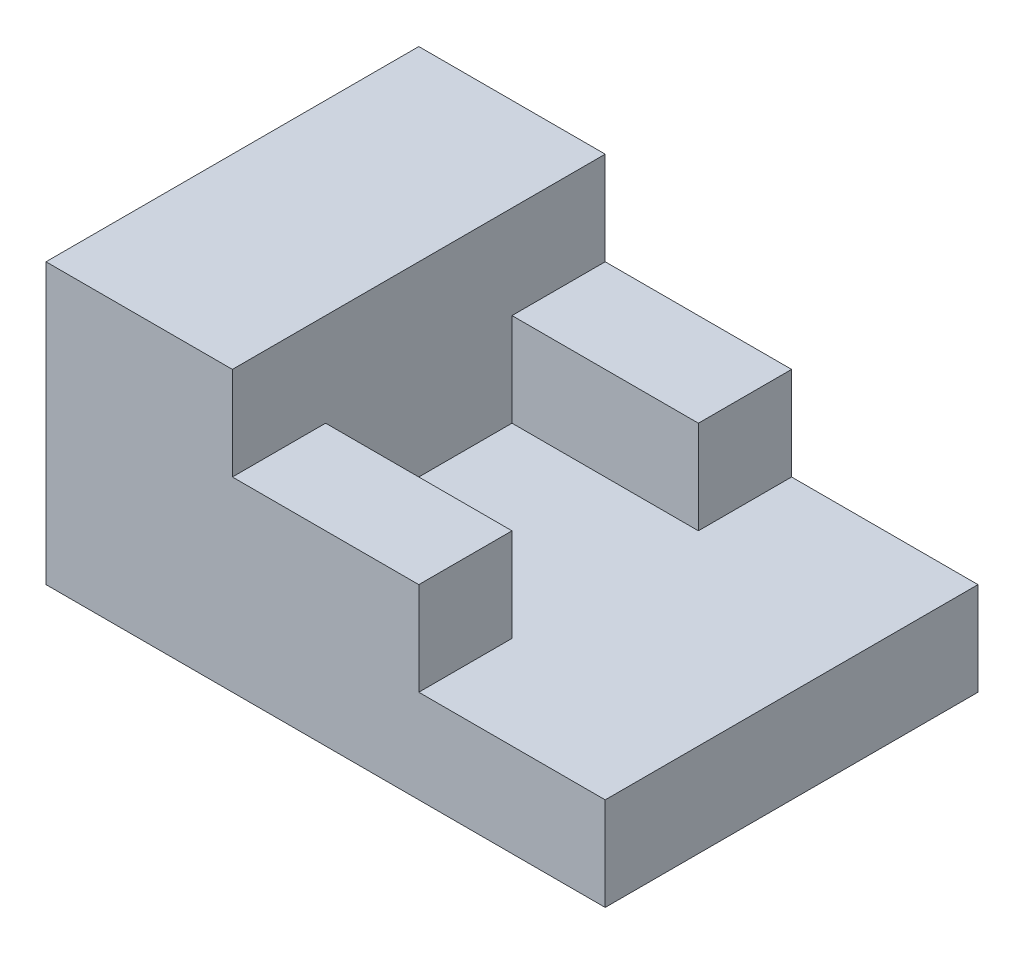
ISO-10303-21;
HEADER;
FILE_DESCRIPTION(('STEP AP214'),'2;1');
FILE_NAME('part.step','',(''),(''),'','','');
FILE_SCHEMA(('AUTOMOTIVE_DESIGN { 1 0 10303 214 1 1 1 1 }'));
ENDSEC;
DATA;
#1=APPLICATION_CONTEXT('core data for automotive mechanical design processes');
#2=APPLICATION_PROTOCOL_DEFINITION('international standard','automotive_design',2000,#1);
#3=PRODUCT_CONTEXT('',#1,'mechanical');
#4=PRODUCT('Part','Part','',(#3));
#5=PRODUCT_RELATED_PRODUCT_CATEGORY('part','',(#4));
#6=PRODUCT_DEFINITION_FORMATION('','',#4);
#7=PRODUCT_DEFINITION_CONTEXT('part definition',#1,'design');
#8=PRODUCT_DEFINITION('design','',#6,#7);
#9=PRODUCT_DEFINITION_SHAPE('','',#8);
#10=(LENGTH_UNIT() NAMED_UNIT(*) SI_UNIT(.MILLI.,.METRE.));
#11=(NAMED_UNIT(*) PLANE_ANGLE_UNIT() SI_UNIT($,.RADIAN.));
#12=(NAMED_UNIT(*) SI_UNIT($,.STERADIAN.) SOLID_ANGLE_UNIT());
#13=UNCERTAINTY_MEASURE_WITH_UNIT(LENGTH_MEASURE(1.E-05),#10,'distance_accuracy_value','');
#14=(GEOMETRIC_REPRESENTATION_CONTEXT(3) GLOBAL_UNCERTAINTY_ASSIGNED_CONTEXT((#13)) GLOBAL_UNIT_ASSIGNED_CONTEXT((#10,
#11,#12)) REPRESENTATION_CONTEXT('',''));
#15=CARTESIAN_POINT('',(0.,0.,0.));
#16=DIRECTION('',(0.,0.,1.));
#17=DIRECTION('',(1.,0.,0.));
#18=AXIS2_PLACEMENT_3D('',#15,#16,#17);
#19=CARTESIAN_POINT('',(-26.2306360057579,10.,20.));
#20=DIRECTION('',(0.,0.,-1.));
#21=DIRECTION('',(-1.,0.,0.));
#22=AXIS2_PLACEMENT_3D('',#19,#20,#21);
#23=PLANE('',#22);
#24=DIRECTION('',(1.,0.,0.));
#25=VECTOR('',#24,1.);
#26=CARTESIAN_POINT('',(-26.2306360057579,0.,20.));
#27=LINE('',#26,#25);
#28=CARTESIAN_POINT('',(0.,0.,20.));
#29=VERTEX_POINT('',#28);
#30=CARTESIAN_POINT('',(60.,0.,20.));
#31=VERTEX_POINT('',#30);
#32=EDGE_CURVE('E107',#29,#31,#27,.T.);
#33=ORIENTED_EDGE('',*,*,#32,.T.);
#34=DIRECTION('',(0.,-1.,0.));
#35=VECTOR('',#34,1.);
#36=CARTESIAN_POINT('',(60.,10.,20.));
#37=LINE('',#36,#35);
#38=CARTESIAN_POINT('',(60.,10.,20.));
#39=VERTEX_POINT('',#38);
#40=EDGE_CURVE('E11',#39,#31,#37,.T.);
#41=ORIENTED_EDGE('',*,*,#40,.F.);
#42=DIRECTION('',(1.,0.,0.));
#43=VECTOR('',#42,1.);
#44=CARTESIAN_POINT('',(-26.2306360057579,10.,20.));
#45=LINE('',#44,#43);
#46=CARTESIAN_POINT('',(40.,10.,20.));
#47=VERTEX_POINT('',#46);
#48=EDGE_CURVE('E82',#47,#39,#45,.T.);
#49=ORIENTED_EDGE('',*,*,#48,.F.);
#50=DIRECTION('',(0.,-1.,0.));
#51=VECTOR('',#50,1.);
#52=CARTESIAN_POINT('',(40.,20.,20.));
#53=LINE('',#52,#51);
#54=CARTESIAN_POINT('',(40.,20.,20.));
#55=VERTEX_POINT('',#54);
#56=EDGE_CURVE('E90',#55,#47,#53,.T.);
#57=ORIENTED_EDGE('',*,*,#56,.F.);
#58=DIRECTION('',(1.,0.,0.));
#59=VECTOR('',#58,1.);
#60=CARTESIAN_POINT('',(-26.2306360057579,20.,20.));
#61=LINE('',#60,#59);
#62=CARTESIAN_POINT('',(20.,20.,20.));
#63=VERTEX_POINT('',#62);
#64=EDGE_CURVE('E67',#63,#55,#61,.T.);
#65=ORIENTED_EDGE('',*,*,#64,.F.);
#66=DIRECTION('',(0.,-1.,0.));
#67=VECTOR('',#66,1.);
#68=CARTESIAN_POINT('',(20.,30.,20.));
#69=LINE('',#68,#67);
#70=CARTESIAN_POINT('',(20.,30.,20.));
#71=VERTEX_POINT('',#70);
#72=EDGE_CURVE('E164',#71,#63,#69,.T.);
#73=ORIENTED_EDGE('',*,*,#72,.F.);
#74=DIRECTION('',(1.,0.,0.));
#75=VECTOR('',#74,1.);
#76=CARTESIAN_POINT('',(-26.2306360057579,30.,20.));
#77=LINE('',#76,#75);
#78=CARTESIAN_POINT('',(0.,30.,20.));
#79=VERTEX_POINT('',#78);
#80=EDGE_CURVE('E169',#79,#71,#77,.T.);
#81=ORIENTED_EDGE('',*,*,#80,.F.);
#82=DIRECTION('',(0.,-1.,0.));
#83=VECTOR('',#82,1.);
#84=CARTESIAN_POINT('',(0.,30.,20.));
#85=LINE('',#84,#83);
#86=EDGE_CURVE('E168',#79,#29,#85,.T.);
#87=ORIENTED_EDGE('',*,*,#86,.T.);
#88=EDGE_LOOP('',(#33,#41,#49,#57,#65,#73,#81,#87));
#89=FACE_BOUND('',#88,.T.);
#90=ADVANCED_FACE('F32',(#89),#23,.F.);
#91=CARTESIAN_POINT('',(60.,10.,0.));
#92=DIRECTION('',(1.,0.,0.));
#93=DIRECTION('',(0.,0.,-1.));
#94=AXIS2_PLACEMENT_3D('',#91,#92,#93);
#95=PLANE('',#94);
#96=DIRECTION('',(0.,0.,1.));
#97=VECTOR('',#96,1.);
#98=CARTESIAN_POINT('',(60.,0.,0.));
#99=LINE('',#98,#97);
#100=CARTESIAN_POINT('',(60.,0.,-20.));
#101=VERTEX_POINT('',#100);
#102=EDGE_CURVE('E123',#101,#31,#99,.T.);
#103=ORIENTED_EDGE('',*,*,#102,.F.);
#104=DIRECTION('',(0.,-1.,0.));
#105=VECTOR('',#104,1.);
#106=CARTESIAN_POINT('',(60.,10.,-20.));
#107=LINE('',#106,#105);
#108=CARTESIAN_POINT('',(60.,10.,-20.));
#109=VERTEX_POINT('',#108);
#110=EDGE_CURVE('E41',#109,#101,#107,.T.);
#111=ORIENTED_EDGE('',*,*,#110,.F.);
#112=DIRECTION('',(0.,0.,1.));
#113=VECTOR('',#112,1.);
#114=CARTESIAN_POINT('',(60.,10.,0.));
#115=LINE('',#114,#113);
#116=EDGE_CURVE('E92',#109,#39,#115,.T.);
#117=ORIENTED_EDGE('',*,*,#116,.T.);
#118=ORIENTED_EDGE('',*,*,#40,.T.);
#119=EDGE_LOOP('',(#103,#111,#117,#118));
#120=FACE_BOUND('',#119,.T.);
#121=ADVANCED_FACE('F221',(#120),#95,.T.);
#122=CARTESIAN_POINT('',(-26.2306360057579,10.,-20.));
#123=DIRECTION('',(0.,0.,-1.));
#124=DIRECTION('',(-1.,0.,0.));
#125=AXIS2_PLACEMENT_3D('',#122,#123,#124);
#126=PLANE('',#125);
#127=DIRECTION('',(1.,0.,0.));
#128=VECTOR('',#127,1.);
#129=CARTESIAN_POINT('',(-26.2306360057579,0.,-20.));
#130=LINE('',#129,#128);
#131=CARTESIAN_POINT('',(0.,0.,-20.));
#132=VERTEX_POINT('',#131);
#133=EDGE_CURVE('E110',#132,#101,#130,.T.);
#134=ORIENTED_EDGE('',*,*,#133,.F.);
#135=DIRECTION('',(0.,-1.,0.));
#136=VECTOR('',#135,1.);
#137=CARTESIAN_POINT('',(0.,30.,-20.));
#138=LINE('',#137,#136);
#139=CARTESIAN_POINT('',(0.,30.,-20.));
#140=VERTEX_POINT('',#139);
#141=EDGE_CURVE('E178',#140,#132,#138,.T.);
#142=ORIENTED_EDGE('',*,*,#141,.F.);
#143=DIRECTION('',(1.,0.,0.));
#144=VECTOR('',#143,1.);
#145=CARTESIAN_POINT('',(-26.2306360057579,30.,-20.));
#146=LINE('',#145,#144);
#147=CARTESIAN_POINT('',(20.,30.,-20.));
#148=VERTEX_POINT('',#147);
#149=EDGE_CURVE('E198',#140,#148,#146,.T.);
#150=ORIENTED_EDGE('',*,*,#149,.T.);
#151=DIRECTION('',(0.,-1.,0.));
#152=VECTOR('',#151,1.);
#153=CARTESIAN_POINT('',(20.,30.,-20.));
#154=LINE('',#153,#152);
#155=CARTESIAN_POINT('',(20.,20.,-20.));
#156=VERTEX_POINT('',#155);
#157=EDGE_CURVE('E163',#148,#156,#154,.T.);
#158=ORIENTED_EDGE('',*,*,#157,.T.);
#159=DIRECTION('',(1.,0.,0.));
#160=VECTOR('',#159,1.);
#161=CARTESIAN_POINT('',(-26.2306360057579,20.,-20.));
#162=LINE('',#161,#160);
#163=CARTESIAN_POINT('',(40.,20.,-20.));
#164=VERTEX_POINT('',#163);
#165=EDGE_CURVE('E133',#156,#164,#162,.T.);
#166=ORIENTED_EDGE('',*,*,#165,.T.);
#167=DIRECTION('',(0.,-1.,0.));
#168=VECTOR('',#167,1.);
#169=CARTESIAN_POINT('',(40.,20.,-20.));
#170=LINE('',#169,#168);
#171=CARTESIAN_POINT('',(40.,10.,-20.));
#172=VERTEX_POINT('',#171);
#173=EDGE_CURVE('E153',#164,#172,#170,.T.);
#174=ORIENTED_EDGE('',*,*,#173,.T.);
#175=DIRECTION('',(1.,0.,0.));
#176=VECTOR('',#175,1.);
#177=CARTESIAN_POINT('',(-26.2306360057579,10.,-20.));
#178=LINE('',#177,#176);
#179=EDGE_CURVE('E113',#172,#109,#178,.T.);
#180=ORIENTED_EDGE('',*,*,#179,.T.);
#181=ORIENTED_EDGE('',*,*,#110,.T.);
#182=EDGE_LOOP('',(#134,#142,#150,#158,#166,#174,#180,#181));
#183=FACE_BOUND('',#182,.T.);
#184=ADVANCED_FACE('F194',(#183),#126,.T.);
#185=CARTESIAN_POINT('',(-26.2306360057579,10.,0.));
#186=DIRECTION('',(0.,1.,0.));
#187=DIRECTION('',(0.,0.,1.));
#188=AXIS2_PLACEMENT_3D('',#185,#186,#187);
#189=PLANE('',#188);
#190=DIRECTION('',(0.,0.,1.));
#191=VECTOR('',#190,1.);
#192=CARTESIAN_POINT('',(20.,10.,0.));
#193=LINE('',#192,#191);
#194=CARTESIAN_POINT('',(20.,10.,-10.));
#195=VERTEX_POINT('',#194);
#196=CARTESIAN_POINT('',(20.,10.,10.));
#197=VERTEX_POINT('',#196);
#198=EDGE_CURVE('E108',#195,#197,#193,.T.);
#199=ORIENTED_EDGE('',*,*,#198,.T.);
#200=DIRECTION('',(1.,0.,0.));
#201=VECTOR('',#200,1.);
#202=CARTESIAN_POINT('',(-26.2306360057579,10.,10.));
#203=LINE('',#202,#201);
#204=CARTESIAN_POINT('',(40.,10.,10.));
#205=VERTEX_POINT('',#204);
#206=EDGE_CURVE('E84',#197,#205,#203,.T.);
#207=ORIENTED_EDGE('',*,*,#206,.T.);
#208=DIRECTION('',(0.,0.,1.));
#209=VECTOR('',#208,1.);
#210=CARTESIAN_POINT('',(40.,10.,0.));
#211=LINE('',#210,#209);
#212=EDGE_CURVE('E78',#205,#47,#211,.T.);
#213=ORIENTED_EDGE('',*,*,#212,.T.);
#214=ORIENTED_EDGE('',*,*,#48,.T.);
#215=ORIENTED_EDGE('',*,*,#116,.F.);
#216=ORIENTED_EDGE('',*,*,#179,.F.);
#217=DIRECTION('',(0.,0.,-1.));
#218=VECTOR('',#217,1.);
#219=CARTESIAN_POINT('',(40.,10.,0.));
#220=LINE('',#219,#218);
#221=CARTESIAN_POINT('',(40.,10.,-10.));
#222=VERTEX_POINT('',#221);
#223=EDGE_CURVE('E116',#222,#172,#220,.T.);
#224=ORIENTED_EDGE('',*,*,#223,.F.);
#225=DIRECTION('',(1.,0.,0.));
#226=VECTOR('',#225,1.);
#227=CARTESIAN_POINT('',(-26.2306360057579,10.,-10.));
#228=LINE('',#227,#226);
#229=EDGE_CURVE('E119',#195,#222,#228,.T.);
#230=ORIENTED_EDGE('',*,*,#229,.F.);
#231=EDGE_LOOP('',(#199,#207,#213,#214,#215,#216,#224,#230));
#232=FACE_BOUND('',#231,.T.);
#233=ADVANCED_FACE('F81',(#232),#189,.T.);
#234=CARTESIAN_POINT('',(-26.2306360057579,0.,0.));
#235=DIRECTION('',(0.,1.,0.));
#236=DIRECTION('',(0.,0.,1.));
#237=AXIS2_PLACEMENT_3D('',#234,#235,#236);
#238=PLANE('',#237);
#239=ORIENTED_EDGE('',*,*,#32,.F.);
#240=DIRECTION('',(0.,0.,1.));
#241=VECTOR('',#240,1.);
#242=CARTESIAN_POINT('',(0.,0.,0.));
#243=LINE('',#242,#241);
#244=EDGE_CURVE('E174',#132,#29,#243,.T.);
#245=ORIENTED_EDGE('',*,*,#244,.F.);
#246=ORIENTED_EDGE('',*,*,#133,.T.);
#247=ORIENTED_EDGE('',*,*,#102,.T.);
#248=EDGE_LOOP('',(#239,#245,#246,#247));
#249=FACE_BOUND('',#248,.T.);
#250=ADVANCED_FACE('F229',(#249),#238,.F.);
#251=CARTESIAN_POINT('',(40.,20.,0.));
#252=DIRECTION('',(1.,0.,0.));
#253=DIRECTION('',(0.,0.,-1.));
#254=AXIS2_PLACEMENT_3D('',#251,#252,#253);
#255=PLANE('',#254);
#256=ORIENTED_EDGE('',*,*,#56,.T.);
#257=ORIENTED_EDGE('',*,*,#212,.F.);
#258=DIRECTION('',(0.,-1.,0.));
#259=VECTOR('',#258,1.);
#260=CARTESIAN_POINT('',(40.,20.,10.));
#261=LINE('',#260,#259);
#262=CARTESIAN_POINT('',(40.,20.,10.));
#263=VERTEX_POINT('',#262);
#264=EDGE_CURVE('E99',#263,#205,#261,.T.);
#265=ORIENTED_EDGE('',*,*,#264,.F.);
#266=DIRECTION('',(0.,0.,1.));
#267=VECTOR('',#266,1.);
#268=CARTESIAN_POINT('',(40.,20.,0.));
#269=LINE('',#268,#267);
#270=EDGE_CURVE('E95',#263,#55,#269,.T.);
#271=ORIENTED_EDGE('',*,*,#270,.T.);
#272=EDGE_LOOP('',(#256,#257,#265,#271));
#273=FACE_BOUND('',#272,.T.);
#274=ADVANCED_FACE('F94',(#273),#255,.T.);
#275=CARTESIAN_POINT('',(-26.2306360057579,20.,10.));
#276=DIRECTION('',(0.,0.,-1.));
#277=DIRECTION('',(-1.,0.,0.));
#278=AXIS2_PLACEMENT_3D('',#275,#276,#277);
#279=PLANE('',#278);
#280=ORIENTED_EDGE('',*,*,#264,.T.);
#281=ORIENTED_EDGE('',*,*,#206,.F.);
#282=DIRECTION('',(0.,-1.,0.));
#283=VECTOR('',#282,1.);
#284=CARTESIAN_POINT('',(20.,20.,10.));
#285=LINE('',#284,#283);
#286=CARTESIAN_POINT('',(20.,20.,10.));
#287=VERTEX_POINT('',#286);
#288=EDGE_CURVE('E96',#287,#197,#285,.T.);
#289=ORIENTED_EDGE('',*,*,#288,.F.);
#290=DIRECTION('',(1.,0.,0.));
#291=VECTOR('',#290,1.);
#292=CARTESIAN_POINT('',(-26.2306360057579,20.,10.));
#293=LINE('',#292,#291);
#294=EDGE_CURVE('E141',#287,#263,#293,.T.);
#295=ORIENTED_EDGE('',*,*,#294,.T.);
#296=EDGE_LOOP('',(#280,#281,#289,#295));
#297=FACE_BOUND('',#296,.T.);
#298=ADVANCED_FACE('F237',(#297),#279,.T.);
#299=CARTESIAN_POINT('',(-26.2306360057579,20.,0.));
#300=DIRECTION('',(0.,1.,0.));
#301=DIRECTION('',(0.,0.,1.));
#302=AXIS2_PLACEMENT_3D('',#299,#300,#301);
#303=PLANE('',#302);
#304=ORIENTED_EDGE('',*,*,#270,.F.);
#305=ORIENTED_EDGE('',*,*,#294,.F.);
#306=DIRECTION('',(0.,0.,1.));
#307=VECTOR('',#306,1.);
#308=CARTESIAN_POINT('',(20.,20.,0.));
#309=LINE('',#308,#307);
#310=EDGE_CURVE('E101',#287,#63,#309,.T.);
#311=ORIENTED_EDGE('',*,*,#310,.T.);
#312=ORIENTED_EDGE('',*,*,#64,.T.);
#313=EDGE_LOOP('',(#304,#305,#311,#312));
#314=FACE_BOUND('',#313,.T.);
#315=ADVANCED_FACE('F240',(#314),#303,.T.);
#316=CARTESIAN_POINT('',(-26.2306360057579,20.,-10.));
#317=DIRECTION('',(0.,0.,-1.));
#318=DIRECTION('',(-1.,0.,0.));
#319=AXIS2_PLACEMENT_3D('',#316,#317,#318);
#320=PLANE('',#319);
#321=ORIENTED_EDGE('',*,*,#229,.T.);
#322=DIRECTION('',(0.,-1.,0.));
#323=VECTOR('',#322,1.);
#324=CARTESIAN_POINT('',(40.,20.,-10.));
#325=LINE('',#324,#323);
#326=CARTESIAN_POINT('',(40.,20.,-10.));
#327=VERTEX_POINT('',#326);
#328=EDGE_CURVE('E148',#327,#222,#325,.T.);
#329=ORIENTED_EDGE('',*,*,#328,.F.);
#330=DIRECTION('',(1.,0.,0.));
#331=VECTOR('',#330,1.);
#332=CARTESIAN_POINT('',(-26.2306360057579,20.,-10.));
#333=LINE('',#332,#331);
#334=CARTESIAN_POINT('',(20.,20.,-10.));
#335=VERTEX_POINT('',#334);
#336=EDGE_CURVE('E160',#335,#327,#333,.T.);
#337=ORIENTED_EDGE('',*,*,#336,.F.);
#338=DIRECTION('',(0.,-1.,0.));
#339=VECTOR('',#338,1.);
#340=CARTESIAN_POINT('',(20.,20.,-10.));
#341=LINE('',#340,#339);
#342=EDGE_CURVE('E132',#335,#195,#341,.T.);
#343=ORIENTED_EDGE('',*,*,#342,.T.);
#344=EDGE_LOOP('',(#321,#329,#337,#343));
#345=FACE_BOUND('',#344,.T.);
#346=ADVANCED_FACE('F243',(#345),#320,.F.);
#347=CARTESIAN_POINT('',(40.,20.,0.));
#348=DIRECTION('',(-1.,0.,0.));
#349=DIRECTION('',(0.,0.,1.));
#350=AXIS2_PLACEMENT_3D('',#347,#348,#349);
#351=PLANE('',#350);
#352=ORIENTED_EDGE('',*,*,#223,.T.);
#353=ORIENTED_EDGE('',*,*,#173,.F.);
#354=DIRECTION('',(0.,0.,-1.));
#355=VECTOR('',#354,1.);
#356=CARTESIAN_POINT('',(40.,20.,0.));
#357=LINE('',#356,#355);
#358=EDGE_CURVE('E138',#327,#164,#357,.T.);
#359=ORIENTED_EDGE('',*,*,#358,.F.);
#360=ORIENTED_EDGE('',*,*,#328,.T.);
#361=EDGE_LOOP('',(#352,#353,#359,#360));
#362=FACE_BOUND('',#361,.T.);
#363=ADVANCED_FACE('F215',(#362),#351,.F.);
#364=CARTESIAN_POINT('',(-26.2306360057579,20.,0.));
#365=DIRECTION('',(0.,1.,0.));
#366=DIRECTION('',(0.,0.,1.));
#367=AXIS2_PLACEMENT_3D('',#364,#365,#366);
#368=PLANE('',#367);
#369=ORIENTED_EDGE('',*,*,#336,.T.);
#370=ORIENTED_EDGE('',*,*,#358,.T.);
#371=ORIENTED_EDGE('',*,*,#165,.F.);
#372=DIRECTION('',(0.,0.,1.));
#373=VECTOR('',#372,1.);
#374=CARTESIAN_POINT('',(20.,20.,0.));
#375=LINE('',#374,#373);
#376=EDGE_CURVE('E129',#156,#335,#375,.T.);
#377=ORIENTED_EDGE('',*,*,#376,.T.);
#378=EDGE_LOOP('',(#369,#370,#371,#377));
#379=FACE_BOUND('',#378,.T.);
#380=ADVANCED_FACE('F206',(#379),#368,.T.);
#381=CARTESIAN_POINT('',(20.,30.,0.));
#382=DIRECTION('',(1.,0.,0.));
#383=DIRECTION('',(0.,0.,-1.));
#384=AXIS2_PLACEMENT_3D('',#381,#382,#383);
#385=PLANE('',#384);
#386=ORIENTED_EDGE('',*,*,#310,.F.);
#387=ORIENTED_EDGE('',*,*,#288,.T.);
#388=ORIENTED_EDGE('',*,*,#198,.F.);
#389=ORIENTED_EDGE('',*,*,#342,.F.);
#390=ORIENTED_EDGE('',*,*,#376,.F.);
#391=ORIENTED_EDGE('',*,*,#157,.F.);
#392=DIRECTION('',(0.,0.,1.));
#393=VECTOR('',#392,1.);
#394=CARTESIAN_POINT('',(20.,30.,0.));
#395=LINE('',#394,#393);
#396=EDGE_CURVE('E263',#148,#71,#395,.T.);
#397=ORIENTED_EDGE('',*,*,#396,.T.);
#398=ORIENTED_EDGE('',*,*,#72,.T.);
#399=EDGE_LOOP('',(#386,#387,#388,#389,#390,#391,#397,#398));
#400=FACE_BOUND('',#399,.T.);
#401=ADVANCED_FACE('F251',(#400),#385,.T.);
#402=CARTESIAN_POINT('',(0.,30.,0.));
#403=DIRECTION('',(1.,0.,0.));
#404=DIRECTION('',(0.,0.,-1.));
#405=AXIS2_PLACEMENT_3D('',#402,#403,#404);
#406=PLANE('',#405);
#407=ORIENTED_EDGE('',*,*,#244,.T.);
#408=ORIENTED_EDGE('',*,*,#86,.F.);
#409=DIRECTION('',(0.,0.,1.));
#410=VECTOR('',#409,1.);
#411=CARTESIAN_POINT('',(0.,30.,0.));
#412=LINE('',#411,#410);
#413=EDGE_CURVE('E271',#140,#79,#412,.T.);
#414=ORIENTED_EDGE('',*,*,#413,.F.);
#415=ORIENTED_EDGE('',*,*,#141,.T.);
#416=EDGE_LOOP('',(#407,#408,#414,#415));
#417=FACE_BOUND('',#416,.T.);
#418=ADVANCED_FACE('F254',(#417),#406,.F.);
#419=CARTESIAN_POINT('',(-26.2306360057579,30.,0.));
#420=DIRECTION('',(0.,1.,0.));
#421=DIRECTION('',(0.,0.,1.));
#422=AXIS2_PLACEMENT_3D('',#419,#420,#421);
#423=PLANE('',#422);
#424=ORIENTED_EDGE('',*,*,#396,.F.);
#425=ORIENTED_EDGE('',*,*,#149,.F.);
#426=ORIENTED_EDGE('',*,*,#413,.T.);
#427=ORIENTED_EDGE('',*,*,#80,.T.);
#428=EDGE_LOOP('',(#424,#425,#426,#427));
#429=FACE_BOUND('',#428,.T.);
#430=ADVANCED_FACE('F257',(#429),#423,.T.);
#431=CLOSED_SHELL('',(#90,#121,#184,#233,#250,#274,#298,#315,#346,#363,#380,#401,#418,#430));
#432=MANIFOLD_SOLID_BREP('B2',#431);
#433=ADVANCED_BREP_SHAPE_REPRESENTATION('',(#18,#432),#14);
#434=SHAPE_DEFINITION_REPRESENTATION(#9,#433);
ENDSEC;
END-ISO-10303-21;
